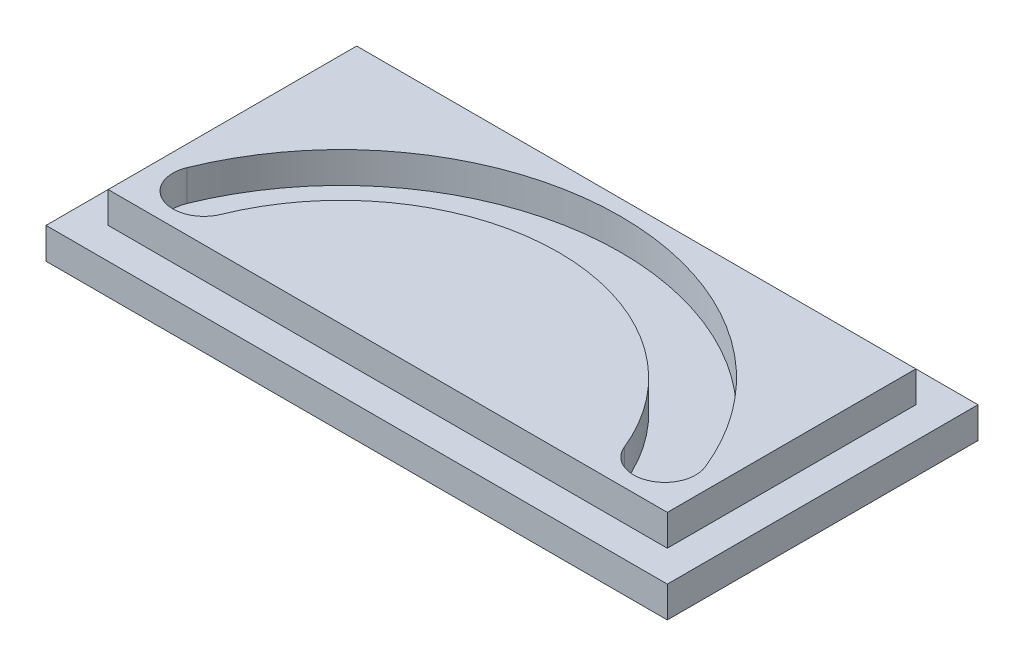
ISO-10303-21;
HEADER;
FILE_DESCRIPTION(('STEP AP214'),'2;1');
FILE_NAME('part.step','',(''),(''),'','','');
FILE_SCHEMA(('AUTOMOTIVE_DESIGN { 1 0 10303 214 1 1 1 1 }'));
ENDSEC;
DATA;
#1=APPLICATION_CONTEXT('core data for automotive mechanical design processes');
#2=APPLICATION_PROTOCOL_DEFINITION('international standard','automotive_design',2000,#1);
#3=PRODUCT_CONTEXT('',#1,'mechanical');
#4=PRODUCT('Part','Part','',(#3));
#5=PRODUCT_RELATED_PRODUCT_CATEGORY('part','',(#4));
#6=PRODUCT_DEFINITION_FORMATION('','',#4);
#7=PRODUCT_DEFINITION_CONTEXT('part definition',#1,'design');
#8=PRODUCT_DEFINITION('design','',#6,#7);
#9=PRODUCT_DEFINITION_SHAPE('','',#8);
#10=(LENGTH_UNIT() NAMED_UNIT(*) SI_UNIT(.MILLI.,.METRE.));
#11=(NAMED_UNIT(*) PLANE_ANGLE_UNIT() SI_UNIT($,.RADIAN.));
#12=(NAMED_UNIT(*) SI_UNIT($,.STERADIAN.) SOLID_ANGLE_UNIT());
#13=UNCERTAINTY_MEASURE_WITH_UNIT(LENGTH_MEASURE(1.E-05),#10,'distance_accuracy_value','');
#14=(GEOMETRIC_REPRESENTATION_CONTEXT(3) GLOBAL_UNCERTAINTY_ASSIGNED_CONTEXT((#13)) GLOBAL_UNIT_ASSIGNED_CONTEXT((#10,
#11,#12)) REPRESENTATION_CONTEXT('',''));
#15=CARTESIAN_POINT('',(0.,0.,0.));
#16=DIRECTION('',(0.,0.,1.));
#17=DIRECTION('',(1.,0.,0.));
#18=AXIS2_PLACEMENT_3D('',#15,#16,#17);
#19=CARTESIAN_POINT('',(0.,10.,50.));
#20=DIRECTION('',(0.,0.,-1.));
#21=DIRECTION('',(-1.,0.,0.));
#22=AXIS2_PLACEMENT_3D('',#19,#20,#21);
#23=PLANE('',#22);
#24=DIRECTION('',(1.,0.,0.));
#25=VECTOR('',#24,1.);
#26=CARTESIAN_POINT('',(0.,0.,50.));
#27=LINE('',#26,#25);
#28=CARTESIAN_POINT('',(-100.,0.,50.));
#29=VERTEX_POINT('',#28);
#30=CARTESIAN_POINT('',(100.,0.,50.));
#31=VERTEX_POINT('',#30);
#32=EDGE_CURVE('E189',#29,#31,#27,.T.);
#33=ORIENTED_EDGE('',*,*,#32,.T.);
#34=DIRECTION('',(0.,-1.,0.));
#35=VECTOR('',#34,1.);
#36=CARTESIAN_POINT('',(100.,10.,50.));
#37=LINE('',#36,#35);
#38=CARTESIAN_POINT('',(100.,10.,50.));
#39=VERTEX_POINT('',#38);
#40=EDGE_CURVE('E11',#39,#31,#37,.T.);
#41=ORIENTED_EDGE('',*,*,#40,.F.);
#42=DIRECTION('',(1.,0.,0.));
#43=VECTOR('',#42,1.);
#44=CARTESIAN_POINT('',(0.,10.,50.));
#45=LINE('',#44,#43);
#46=CARTESIAN_POINT('',(-100.,10.,50.));
#47=VERTEX_POINT('',#46);
#48=EDGE_CURVE('E190',#47,#39,#45,.T.);
#49=ORIENTED_EDGE('',*,*,#48,.F.);
#50=DIRECTION('',(0.,-1.,0.));
#51=VECTOR('',#50,1.);
#52=CARTESIAN_POINT('',(-100.,10.,50.));
#53=LINE('',#52,#51);
#54=EDGE_CURVE('E202',#47,#29,#53,.T.);
#55=ORIENTED_EDGE('',*,*,#54,.T.);
#56=EDGE_LOOP('',(#33,#41,#49,#55));
#57=FACE_BOUND('',#56,.T.);
#58=ADVANCED_FACE('F34',(#57),#23,.F.);
#59=CARTESIAN_POINT('',(100.,10.,0.));
#60=DIRECTION('',(-1.,0.,0.));
#61=DIRECTION('',(0.,0.,1.));
#62=AXIS2_PLACEMENT_3D('',#59,#60,#61);
#63=PLANE('',#62);
#64=DIRECTION('',(0.,0.,-1.));
#65=VECTOR('',#64,1.);
#66=CARTESIAN_POINT('',(100.,0.,0.));
#67=LINE('',#66,#65);
#68=CARTESIAN_POINT('',(100.,0.,-50.));
#69=VERTEX_POINT('',#68);
#70=EDGE_CURVE('E205',#31,#69,#67,.T.);
#71=ORIENTED_EDGE('',*,*,#70,.T.);
#72=DIRECTION('',(0.,-1.,0.));
#73=VECTOR('',#72,1.);
#74=CARTESIAN_POINT('',(100.,10.,-50.));
#75=LINE('',#74,#73);
#76=CARTESIAN_POINT('',(100.,10.,-50.));
#77=VERTEX_POINT('',#76);
#78=EDGE_CURVE('E41',#77,#69,#75,.T.);
#79=ORIENTED_EDGE('',*,*,#78,.F.);
#80=DIRECTION('',(0.,0.,-1.));
#81=VECTOR('',#80,1.);
#82=CARTESIAN_POINT('',(100.,10.,0.));
#83=LINE('',#82,#81);
#84=EDGE_CURVE('E193',#39,#77,#83,.T.);
#85=ORIENTED_EDGE('',*,*,#84,.F.);
#86=ORIENTED_EDGE('',*,*,#40,.T.);
#87=EDGE_LOOP('',(#71,#79,#85,#86));
#88=FACE_BOUND('',#87,.T.);
#89=ADVANCED_FACE('F221',(#88),#63,.F.);
#90=CARTESIAN_POINT('',(0.,10.,-50.));
#91=DIRECTION('',(0.,0.,-1.));
#92=DIRECTION('',(-1.,0.,0.));
#93=AXIS2_PLACEMENT_3D('',#90,#91,#92);
#94=PLANE('',#93);
#95=DIRECTION('',(1.,0.,0.));
#96=VECTOR('',#95,1.);
#97=CARTESIAN_POINT('',(0.,0.,-50.));
#98=LINE('',#97,#96);
#99=CARTESIAN_POINT('',(-100.,0.,-50.));
#100=VERTEX_POINT('',#99);
#101=EDGE_CURVE('E208',#100,#69,#98,.T.);
#102=ORIENTED_EDGE('',*,*,#101,.F.);
#103=DIRECTION('',(0.,-1.,0.));
#104=VECTOR('',#103,1.);
#105=CARTESIAN_POINT('',(-100.,10.,-50.));
#106=LINE('',#105,#104);
#107=CARTESIAN_POINT('',(-100.,10.,-50.));
#108=VERTEX_POINT('',#107);
#109=EDGE_CURVE('E214',#108,#100,#106,.T.);
#110=ORIENTED_EDGE('',*,*,#109,.F.);
#111=DIRECTION('',(1.,0.,0.));
#112=VECTOR('',#111,1.);
#113=CARTESIAN_POINT('',(0.,10.,-50.));
#114=LINE('',#113,#112);
#115=EDGE_CURVE('E196',#108,#77,#114,.T.);
#116=ORIENTED_EDGE('',*,*,#115,.T.);
#117=ORIENTED_EDGE('',*,*,#78,.T.);
#118=EDGE_LOOP('',(#102,#110,#116,#117));
#119=FACE_BOUND('',#118,.T.);
#120=ADVANCED_FACE('F218',(#119),#94,.T.);
#121=CARTESIAN_POINT('',(-100.,10.,0.));
#122=DIRECTION('',(-1.,0.,0.));
#123=DIRECTION('',(0.,0.,1.));
#124=AXIS2_PLACEMENT_3D('',#121,#122,#123);
#125=PLANE('',#124);
#126=DIRECTION('',(0.,0.,-1.));
#127=VECTOR('',#126,1.);
#128=CARTESIAN_POINT('',(-100.,0.,0.));
#129=LINE('',#128,#127);
#130=EDGE_CURVE('E194',#29,#100,#129,.T.);
#131=ORIENTED_EDGE('',*,*,#130,.F.);
#132=ORIENTED_EDGE('',*,*,#54,.F.);
#133=DIRECTION('',(0.,0.,-1.));
#134=VECTOR('',#133,1.);
#135=CARTESIAN_POINT('',(-100.,10.,0.));
#136=LINE('',#135,#134);
#137=EDGE_CURVE('E199',#47,#108,#136,.T.);
#138=ORIENTED_EDGE('',*,*,#137,.T.);
#139=ORIENTED_EDGE('',*,*,#109,.T.);
#140=EDGE_LOOP('',(#131,#132,#138,#139));
#141=FACE_BOUND('',#140,.T.);
#142=ADVANCED_FACE('F228',(#141),#125,.T.);
#143=CARTESIAN_POINT('',(0.,10.,0.));
#144=DIRECTION('',(0.,1.,0.));
#145=DIRECTION('',(0.,0.,1.));
#146=AXIS2_PLACEMENT_3D('',#143,#144,#145);
#147=PLANE('',#146);
#148=DIRECTION('',(0.,0.,1.));
#149=VECTOR('',#148,1.);
#150=CARTESIAN_POINT('',(-90.,10.,0.));
#151=LINE('',#150,#149);
#152=CARTESIAN_POINT('',(-90.,10.,-40.));
#153=VERTEX_POINT('',#152);
#154=CARTESIAN_POINT('',(-90.,10.,40.));
#155=VERTEX_POINT('',#154);
#156=EDGE_CURVE('E187',#153,#155,#151,.T.);
#157=ORIENTED_EDGE('',*,*,#156,.F.);
#158=DIRECTION('',(-1.,0.,0.));
#159=VECTOR('',#158,1.);
#160=CARTESIAN_POINT('',(0.,10.,-40.));
#161=LINE('',#160,#159);
#162=CARTESIAN_POINT('',(90.,10.,-40.));
#163=VERTEX_POINT('',#162);
#164=EDGE_CURVE('E173',#163,#153,#161,.T.);
#165=ORIENTED_EDGE('',*,*,#164,.F.);
#166=DIRECTION('',(0.,0.,1.));
#167=VECTOR('',#166,1.);
#168=CARTESIAN_POINT('',(90.,10.,0.));
#169=LINE('',#168,#167);
#170=CARTESIAN_POINT('',(90.,10.,40.));
#171=VERTEX_POINT('',#170);
#172=EDGE_CURVE('E184',#163,#171,#169,.T.);
#173=ORIENTED_EDGE('',*,*,#172,.T.);
#174=DIRECTION('',(-1.,0.,0.));
#175=VECTOR('',#174,1.);
#176=CARTESIAN_POINT('',(0.,10.,40.));
#177=LINE('',#176,#175);
#178=EDGE_CURVE('E56',#171,#155,#177,.T.);
#179=ORIENTED_EDGE('',*,*,#178,.T.);
#180=EDGE_LOOP('',(#157,#165,#173,#179));
#181=FACE_BOUND('',#180,.T.);
#182=ORIENTED_EDGE('',*,*,#48,.T.);
#183=ORIENTED_EDGE('',*,*,#84,.T.);
#184=ORIENTED_EDGE('',*,*,#115,.F.);
#185=ORIENTED_EDGE('',*,*,#137,.F.);
#186=EDGE_LOOP('',(#182,#183,#184,#185));
#187=FACE_BOUND('',#186,.T.);
#188=ADVANCED_FACE('F232',(#181,#187),#147,.T.);
#189=CARTESIAN_POINT('',(0.,0.,0.));
#190=DIRECTION('',(0.,1.,0.));
#191=DIRECTION('',(0.,0.,1.));
#192=AXIS2_PLACEMENT_3D('',#189,#190,#191);
#193=PLANE('',#192);
#194=ORIENTED_EDGE('',*,*,#32,.F.);
#195=ORIENTED_EDGE('',*,*,#130,.T.);
#196=ORIENTED_EDGE('',*,*,#101,.T.);
#197=ORIENTED_EDGE('',*,*,#70,.F.);
#198=EDGE_LOOP('',(#194,#195,#196,#197));
#199=FACE_BOUND('',#198,.T.);
#200=ADVANCED_FACE('F225',(#199),#193,.F.);
#201=CARTESIAN_POINT('',(-90.,20.,40.));
#202=DIRECTION('',(-1.,0.,0.));
#203=DIRECTION('',(0.,0.,1.));
#204=AXIS2_PLACEMENT_3D('',#201,#202,#203);
#205=PLANE('',#204);
#206=DIRECTION('',(0.,-1.,0.));
#207=VECTOR('',#206,1.);
#208=CARTESIAN_POINT('',(-90.,20.,-40.));
#209=LINE('',#208,#207);
#210=CARTESIAN_POINT('',(-90.,20.,-40.));
#211=VERTEX_POINT('',#210);
#212=EDGE_CURVE('E169',#211,#153,#209,.T.);
#213=ORIENTED_EDGE('',*,*,#212,.T.);
#214=ORIENTED_EDGE('',*,*,#156,.T.);
#215=DIRECTION('',(0.,-1.,0.));
#216=VECTOR('',#215,1.);
#217=CARTESIAN_POINT('',(-90.,20.,40.));
#218=LINE('',#217,#216);
#219=CARTESIAN_POINT('',(-90.,20.,40.));
#220=VERTEX_POINT('',#219);
#221=EDGE_CURVE('E170',#220,#155,#218,.T.);
#222=ORIENTED_EDGE('',*,*,#221,.F.);
#223=DIRECTION('',(0.,0.,-1.));
#224=VECTOR('',#223,1.);
#225=CARTESIAN_POINT('',(-90.,20.,40.));
#226=LINE('',#225,#224);
#227=EDGE_CURVE('E156',#220,#211,#226,.T.);
#228=ORIENTED_EDGE('',*,*,#227,.T.);
#229=EDGE_LOOP('',(#213,#214,#222,#228));
#230=FACE_BOUND('',#229,.T.);
#231=ADVANCED_FACE('F247',(#230),#205,.T.);
#232=CARTESIAN_POINT('',(-90.,20.,40.));
#233=DIRECTION('',(0.,0.,-1.));
#234=DIRECTION('',(-1.,0.,0.));
#235=AXIS2_PLACEMENT_3D('',#232,#233,#234);
#236=PLANE('',#235);
#237=ORIENTED_EDGE('',*,*,#178,.F.);
#238=DIRECTION('',(0.,-1.,0.));
#239=VECTOR('',#238,1.);
#240=CARTESIAN_POINT('',(90.,20.,40.));
#241=LINE('',#240,#239);
#242=CARTESIAN_POINT('',(90.,20.,40.));
#243=VERTEX_POINT('',#242);
#244=EDGE_CURVE('E174',#243,#171,#241,.T.);
#245=ORIENTED_EDGE('',*,*,#244,.F.);
#246=DIRECTION('',(1.,0.,0.));
#247=VECTOR('',#246,1.);
#248=CARTESIAN_POINT('',(-90.,20.,40.));
#249=LINE('',#248,#247);
#250=EDGE_CURVE('E167',#220,#243,#249,.T.);
#251=ORIENTED_EDGE('',*,*,#250,.F.);
#252=ORIENTED_EDGE('',*,*,#221,.T.);
#253=EDGE_LOOP('',(#237,#245,#251,#252));
#254=FACE_BOUND('',#253,.T.);
#255=ADVANCED_FACE('F252',(#254),#236,.F.);
#256=CARTESIAN_POINT('',(90.,20.,40.));
#257=DIRECTION('',(-1.,0.,0.));
#258=DIRECTION('',(0.,0.,1.));
#259=AXIS2_PLACEMENT_3D('',#256,#257,#258);
#260=PLANE('',#259);
#261=ORIENTED_EDGE('',*,*,#172,.F.);
#262=DIRECTION('',(0.,-1.,0.));
#263=VECTOR('',#262,1.);
#264=CARTESIAN_POINT('',(90.,20.,-40.));
#265=LINE('',#264,#263);
#266=CARTESIAN_POINT('',(90.,20.,-40.));
#267=VERTEX_POINT('',#266);
#268=EDGE_CURVE('E177',#267,#163,#265,.T.);
#269=ORIENTED_EDGE('',*,*,#268,.F.);
#270=DIRECTION('',(0.,0.,-1.));
#271=VECTOR('',#270,1.);
#272=CARTESIAN_POINT('',(90.,20.,40.));
#273=LINE('',#272,#271);
#274=EDGE_CURVE('E165',#243,#267,#273,.T.);
#275=ORIENTED_EDGE('',*,*,#274,.F.);
#276=ORIENTED_EDGE('',*,*,#244,.T.);
#277=EDGE_LOOP('',(#261,#269,#275,#276));
#278=FACE_BOUND('',#277,.T.);
#279=ADVANCED_FACE('F258',(#278),#260,.F.);
#280=CARTESIAN_POINT('',(-90.,20.,-40.));
#281=DIRECTION('',(0.,0.,-1.));
#282=DIRECTION('',(-1.,0.,0.));
#283=AXIS2_PLACEMENT_3D('',#280,#281,#282);
#284=PLANE('',#283);
#285=ORIENTED_EDGE('',*,*,#268,.T.);
#286=ORIENTED_EDGE('',*,*,#164,.T.);
#287=ORIENTED_EDGE('',*,*,#212,.F.);
#288=DIRECTION('',(1.,0.,0.));
#289=VECTOR('',#288,1.);
#290=CARTESIAN_POINT('',(-90.,20.,-40.));
#291=LINE('',#290,#289);
#292=EDGE_CURVE('E162',#211,#267,#291,.T.);
#293=ORIENTED_EDGE('',*,*,#292,.T.);
#294=EDGE_LOOP('',(#285,#286,#287,#293));
#295=FACE_BOUND('',#294,.T.);
#296=ADVANCED_FACE('F254',(#295),#284,.T.);
#297=CARTESIAN_POINT('',(0.,20.,0.));
#298=DIRECTION('',(0.,-1.,0.));
#299=DIRECTION('',(0.,0.,-1.));
#300=AXIS2_PLACEMENT_3D('',#297,#298,#299);
#301=PLANE('',#300);
#302=CARTESIAN_POINT('',(0.,20.,55.));
#303=DIRECTION('',(0.,1.,0.));
#304=DIRECTION('',(0.,0.,1.));
#305=AXIS2_PLACEMENT_3D('',#302,#303,#304);
#306=CIRCLE('',#305,90.);
#307=CARTESIAN_POINT('',(83.4322329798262,20.,21.25));
#308=VERTEX_POINT('',#307);
#309=CARTESIAN_POINT('',(-83.4322329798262,20.,21.25));
#310=VERTEX_POINT('',#309);
#311=EDGE_CURVE('E150',#308,#310,#306,.T.);
#312=ORIENTED_EDGE('',*,*,#311,.F.);
#313=CARTESIAN_POINT('',(74.1619848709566,20.,25.));
#314=DIRECTION('',(0.,1.,0.));
#315=DIRECTION('',(0.,0.,1.));
#316=AXIS2_PLACEMENT_3D('',#313,#314,#315);
#317=CIRCLE('',#316,9.99999999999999);
#318=CARTESIAN_POINT('',(64.891736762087,20.,28.75));
#319=VERTEX_POINT('',#318);
#320=EDGE_CURVE('E48',#319,#308,#317,.T.);
#321=ORIENTED_EDGE('',*,*,#320,.F.);
#322=CARTESIAN_POINT('',(0.,20.,55.));
#323=DIRECTION('',(0.,1.,0.));
#324=DIRECTION('',(0.,0.,1.));
#325=AXIS2_PLACEMENT_3D('',#322,#323,#324);
#326=CIRCLE('',#325,70.);
#327=CARTESIAN_POINT('',(-64.8917367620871,20.,28.75));
#328=VERTEX_POINT('',#327);
#329=EDGE_CURVE('E141',#319,#328,#326,.T.);
#330=ORIENTED_EDGE('',*,*,#329,.T.);
#331=CARTESIAN_POINT('',(-74.1619848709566,20.,25.));
#332=DIRECTION('',(0.,1.,0.));
#333=DIRECTION('',(0.,0.,1.));
#334=AXIS2_PLACEMENT_3D('',#331,#332,#333);
#335=CIRCLE('',#334,9.99999999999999);
#336=EDGE_CURVE('E144',#310,#328,#335,.T.);
#337=ORIENTED_EDGE('',*,*,#336,.F.);
#338=EDGE_LOOP('',(#312,#321,#330,#337));
#339=FACE_BOUND('',#338,.T.);
#340=ORIENTED_EDGE('',*,*,#227,.F.);
#341=ORIENTED_EDGE('',*,*,#250,.T.);
#342=ORIENTED_EDGE('',*,*,#274,.T.);
#343=ORIENTED_EDGE('',*,*,#292,.F.);
#344=EDGE_LOOP('',(#340,#341,#342,#343));
#345=FACE_BOUND('',#344,.T.);
#346=ADVANCED_FACE('F257',(#339,#345),#301,.F.);
#347=CARTESIAN_POINT('',(74.1619848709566,10.,25.));
#348=DIRECTION('',(0.,1.,0.));
#349=DIRECTION('',(0.,0.,1.));
#350=AXIS2_PLACEMENT_3D('',#347,#348,#349);
#351=CYLINDRICAL_SURFACE('',#350,9.99999999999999);
#352=ORIENTED_EDGE('',*,*,#320,.T.);
#353=DIRECTION('',(0.,1.,0.));
#354=VECTOR('',#353,1.);
#355=CARTESIAN_POINT('',(83.4322329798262,10.,21.25));
#356=LINE('',#355,#354);
#357=CARTESIAN_POINT('',(83.4322329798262,10.,21.25));
#358=VERTEX_POINT('',#357);
#359=EDGE_CURVE('E120',#358,#308,#356,.T.);
#360=ORIENTED_EDGE('',*,*,#359,.F.);
#361=CARTESIAN_POINT('',(74.1619848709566,10.,25.));
#362=DIRECTION('',(0.,1.,0.));
#363=DIRECTION('',(0.,0.,1.));
#364=AXIS2_PLACEMENT_3D('',#361,#362,#363);
#365=CIRCLE('',#364,9.99999999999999);
#366=CARTESIAN_POINT('',(64.891736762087,10.,28.75));
#367=VERTEX_POINT('',#366);
#368=EDGE_CURVE('E124',#367,#358,#365,.T.);
#369=ORIENTED_EDGE('',*,*,#368,.F.);
#370=DIRECTION('',(0.,1.,0.));
#371=VECTOR('',#370,1.);
#372=CARTESIAN_POINT('',(64.891736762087,10.,28.75));
#373=LINE('',#372,#371);
#374=EDGE_CURVE('E154',#367,#319,#373,.T.);
#375=ORIENTED_EDGE('',*,*,#374,.T.);
#376=EDGE_LOOP('',(#352,#360,#369,#375));
#377=FACE_BOUND('',#376,.T.);
#378=ADVANCED_FACE('F122',(#377),#351,.F.);
#379=CARTESIAN_POINT('',(0.,10.,55.));
#380=DIRECTION('',(0.,1.,0.));
#381=DIRECTION('',(0.,0.,1.));
#382=AXIS2_PLACEMENT_3D('',#379,#380,#381);
#383=CYLINDRICAL_SURFACE('',#382,70.);
#384=ORIENTED_EDGE('',*,*,#329,.F.);
#385=ORIENTED_EDGE('',*,*,#374,.F.);
#386=CARTESIAN_POINT('',(0.,10.,55.));
#387=DIRECTION('',(0.,1.,0.));
#388=DIRECTION('',(0.,0.,1.));
#389=AXIS2_PLACEMENT_3D('',#386,#387,#388);
#390=CIRCLE('',#389,70.);
#391=CARTESIAN_POINT('',(-64.8917367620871,10.,28.75));
#392=VERTEX_POINT('',#391);
#393=EDGE_CURVE('E129',#367,#392,#390,.T.);
#394=ORIENTED_EDGE('',*,*,#393,.T.);
#395=DIRECTION('',(0.,1.,0.));
#396=VECTOR('',#395,1.);
#397=CARTESIAN_POINT('',(-64.8917367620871,10.,28.75));
#398=LINE('',#397,#396);
#399=EDGE_CURVE('E157',#392,#328,#398,.T.);
#400=ORIENTED_EDGE('',*,*,#399,.T.);
#401=EDGE_LOOP('',(#384,#385,#394,#400));
#402=FACE_BOUND('',#401,.T.);
#403=ADVANCED_FACE('F271',(#402),#383,.T.);
#404=CARTESIAN_POINT('',(-74.1619848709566,10.,25.));
#405=DIRECTION('',(0.,1.,0.));
#406=DIRECTION('',(0.,0.,1.));
#407=AXIS2_PLACEMENT_3D('',#404,#405,#406);
#408=CYLINDRICAL_SURFACE('',#407,9.99999999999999);
#409=ORIENTED_EDGE('',*,*,#336,.T.);
#410=ORIENTED_EDGE('',*,*,#399,.F.);
#411=CARTESIAN_POINT('',(-74.1619848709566,10.,25.));
#412=DIRECTION('',(0.,1.,0.));
#413=DIRECTION('',(0.,0.,1.));
#414=AXIS2_PLACEMENT_3D('',#411,#412,#413);
#415=CIRCLE('',#414,9.99999999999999);
#416=CARTESIAN_POINT('',(-83.4322329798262,10.,21.25));
#417=VERTEX_POINT('',#416);
#418=EDGE_CURVE('E137',#417,#392,#415,.T.);
#419=ORIENTED_EDGE('',*,*,#418,.F.);
#420=DIRECTION('',(0.,1.,0.));
#421=VECTOR('',#420,1.);
#422=CARTESIAN_POINT('',(-83.4322329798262,10.,21.25));
#423=LINE('',#422,#421);
#424=EDGE_CURVE('E128',#417,#310,#423,.T.);
#425=ORIENTED_EDGE('',*,*,#424,.T.);
#426=EDGE_LOOP('',(#409,#410,#419,#425));
#427=FACE_BOUND('',#426,.T.);
#428=ADVANCED_FACE('F274',(#427),#408,.F.);
#429=CARTESIAN_POINT('',(0.,10.,55.));
#430=DIRECTION('',(0.,1.,0.));
#431=DIRECTION('',(0.,0.,1.));
#432=AXIS2_PLACEMENT_3D('',#429,#430,#431);
#433=CYLINDRICAL_SURFACE('',#432,90.);
#434=ORIENTED_EDGE('',*,*,#311,.T.);
#435=ORIENTED_EDGE('',*,*,#424,.F.);
#436=CARTESIAN_POINT('',(0.,10.,55.));
#437=DIRECTION('',(0.,1.,0.));
#438=DIRECTION('',(0.,0.,1.));
#439=AXIS2_PLACEMENT_3D('',#436,#437,#438);
#440=CIRCLE('',#439,90.);
#441=EDGE_CURVE('E132',#358,#417,#440,.T.);
#442=ORIENTED_EDGE('',*,*,#441,.F.);
#443=ORIENTED_EDGE('',*,*,#359,.T.);
#444=EDGE_LOOP('',(#434,#435,#442,#443));
#445=FACE_BOUND('',#444,.T.);
#446=ADVANCED_FACE('F133',(#445),#433,.F.);
#447=CARTESIAN_POINT('',(37.0809924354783,10.,40.));
#448=DIRECTION('',(0.,1.,0.));
#449=DIRECTION('',(0.,0.,1.));
#450=AXIS2_PLACEMENT_3D('',#447,#448,#449);
#451=PLANE('',#450);
#452=ORIENTED_EDGE('',*,*,#368,.T.);
#453=ORIENTED_EDGE('',*,*,#441,.T.);
#454=ORIENTED_EDGE('',*,*,#418,.T.);
#455=ORIENTED_EDGE('',*,*,#393,.F.);
#456=EDGE_LOOP('',(#452,#453,#454,#455));
#457=FACE_BOUND('',#456,.T.);
#458=ADVANCED_FACE('F140',(#457),#451,.T.);
#459=CLOSED_SHELL('',(#58,#89,#120,#142,#188,#200,#231,#255,#279,#296,#346,#378,#403,#428,#446,#458));
#460=MANIFOLD_SOLID_BREP('B2',#459);
#461=ADVANCED_BREP_SHAPE_REPRESENTATION('',(#18,#460),#14);
#462=SHAPE_DEFINITION_REPRESENTATION(#9,#461);
ENDSEC;
END-ISO-10303-21;
